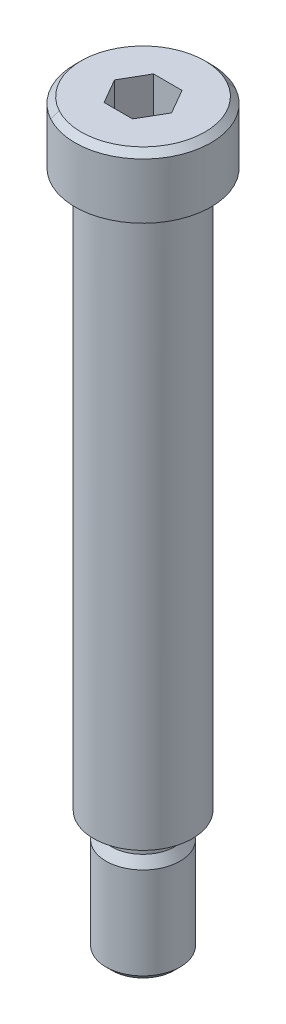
ISO-10303-21;
HEADER;
FILE_DESCRIPTION(('STEP AP214'),'2;1');
FILE_NAME('part.step','',(''),(''),'','','');
FILE_SCHEMA(('AUTOMOTIVE_DESIGN { 1 0 10303 214 1 1 1 1 }'));
ENDSEC;
DATA;
#1=APPLICATION_CONTEXT('core data for automotive mechanical design processes');
#2=APPLICATION_PROTOCOL_DEFINITION('international standard','automotive_design',2000,#1);
#3=PRODUCT_CONTEXT('',#1,'mechanical');
#4=PRODUCT('Part','Part','',(#3));
#5=PRODUCT_RELATED_PRODUCT_CATEGORY('part','',(#4));
#6=PRODUCT_DEFINITION_FORMATION('','',#4);
#7=PRODUCT_DEFINITION_CONTEXT('part definition',#1,'design');
#8=PRODUCT_DEFINITION('design','',#6,#7);
#9=PRODUCT_DEFINITION_SHAPE('','',#8);
#10=(LENGTH_UNIT() NAMED_UNIT(*) SI_UNIT(.MILLI.,.METRE.));
#11=(NAMED_UNIT(*) PLANE_ANGLE_UNIT() SI_UNIT($,.RADIAN.));
#12=(NAMED_UNIT(*) SI_UNIT($,.STERADIAN.) SOLID_ANGLE_UNIT());
#13=UNCERTAINTY_MEASURE_WITH_UNIT(LENGTH_MEASURE(1.E-05),#10,'distance_accuracy_value','');
#14=(GEOMETRIC_REPRESENTATION_CONTEXT(3) GLOBAL_UNCERTAINTY_ASSIGNED_CONTEXT((#13)) GLOBAL_UNIT_ASSIGNED_CONTEXT((#10,
#11,#12)) REPRESENTATION_CONTEXT('',''));
#15=CARTESIAN_POINT('',(0.,0.,0.));
#16=DIRECTION('',(0.,0.,1.));
#17=DIRECTION('',(1.,0.,0.));
#18=AXIS2_PLACEMENT_3D('',#15,#16,#17);
#19=CARTESIAN_POINT('',(0.,-120.,6.00000000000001));
#20=DIRECTION('',(0.,-1.,0.));
#21=DIRECTION('',(0.,0.,-1.));
#22=AXIS2_PLACEMENT_3D('',#19,#20,#21);
#23=PLANE('',#22);
#24=CARTESIAN_POINT('',(0.,-120.00000000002,0.));
#25=DIRECTION('',(0.,1.,0.));
#26=DIRECTION('',(-1.,0.,0.));
#27=AXIS2_PLACEMENT_3D('',#24,#25,#26);
#28=CIRCLE('',#27,5.00000000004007);
#29=CARTESIAN_POINT('',(-2.39712769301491,-120.000000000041,4.38791280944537));
#30=VERTEX_POINT('',#29);
#31=CARTESIAN_POINT('',(2.39712768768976,-120.000000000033,-4.38791281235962));
#32=VERTEX_POINT('',#31);
#33=EDGE_CURVE('E106',#30,#32,#28,.T.);
#34=ORIENTED_EDGE('',*,*,#33,.F.);
#35=CARTESIAN_POINT('',(0.,-120.000000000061,0.));
#36=DIRECTION('',(0.,1.,0.));
#37=DIRECTION('',(-1.,0.,0.));
#38=AXIS2_PLACEMENT_3D('',#35,#36,#37);
#39=CIRCLE('',#38,4.99999999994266);
#40=EDGE_CURVE('E94',#32,#30,#39,.T.);
#41=ORIENTED_EDGE('',*,*,#40,.F.);
#42=EDGE_LOOP('',(#34,#41));
#43=FACE_BOUND('',#42,.T.);
#44=ADVANCED_FACE('F30',(#43),#23,.T.);
#45=CARTESIAN_POINT('',(0.,-119.000000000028,0.));
#46=DIRECTION('',(0.,1.,0.));
#47=DIRECTION('',(-1.,0.,0.));
#48=AXIS2_PLACEMENT_3D('',#45,#46,#47);
#49=CONICAL_SURFACE('',#48,5.99999999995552,0.785398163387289);
#50=CARTESIAN_POINT('',(2.3971276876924,-120.000000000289,-4.38791281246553));
#51=CARTESIAN_POINT('',(2.41710375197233,-119.958333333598,-4.42447875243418));
#52=CARTESIAN_POINT('',(2.43707981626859,-119.916666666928,-4.46104469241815));
#53=CARTESIAN_POINT('',(2.47703194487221,-119.833333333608,-4.53417657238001));
#54=CARTESIAN_POINT('',(2.49700800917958,-119.791666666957,-4.57074251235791));
#55=CARTESIAN_POINT('',(2.53696013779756,-119.708333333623,-4.64387439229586));
#56=CARTESIAN_POINT('',(2.55693620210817,-119.666666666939,-4.68044033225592));
#57=CARTESIAN_POINT('',(2.59688833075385,-119.583333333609,-4.75357221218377));
#58=CARTESIAN_POINT('',(2.61686439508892,-119.541666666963,-4.79013815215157));
#59=CARTESIAN_POINT('',(2.65681652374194,-119.458333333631,-4.86327003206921));
#60=CARTESIAN_POINT('',(2.67679258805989,-119.416666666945,-4.89983597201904));
#61=CARTESIAN_POINT('',(2.71674471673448,-119.333333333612,-4.97296785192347));
#62=CARTESIAN_POINT('',(2.73672078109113,-119.291666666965,-5.00953379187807));
#63=CARTESIAN_POINT('',(2.77667290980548,-119.208333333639,-5.08266567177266));
#64=CARTESIAN_POINT('',(2.79664897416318,-119.16666666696,-5.11923161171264));
#65=CARTESIAN_POINT('',(2.83660110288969,-119.083333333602,-5.19236349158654));
#66=CARTESIAN_POINT('',(2.8565771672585,-119.041666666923,-5.22892943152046));
#67=CARTESIAN_POINT('',(2.87655323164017,-119.000000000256,-5.26549537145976));
#68=B_SPLINE_CURVE_WITH_KNOTS('',3,(#50,#51,#52,#53,#54,#55,#56,#57,#58,#59,#60,#61,#62,#63,#64,
#65,#66,#67),.UNSPECIFIED.,.F.,.F.,(4,2,2,2,2,2,2,2,4),(0.,0.176776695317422,0.353553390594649,
0.530330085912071,0.707106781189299,0.883883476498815,1.06066017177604,1.23743686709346,
1.41421356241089),.UNSPECIFIED.);
#69=CARTESIAN_POINT('',(2.87655323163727,-119.000000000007,-5.26549537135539));
#70=VERTEX_POINT('',#69);
#71=EDGE_CURVE('E101',#32,#70,#68,.T.);
#72=ORIENTED_EDGE('',*,*,#71,.F.);
#73=ORIENTED_EDGE('',*,*,#40,.T.);
#74=DIRECTION('',(0.339005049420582,-0.707106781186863,-0.620544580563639));
#75=VECTOR('',#74,1.);
#76=CARTESIAN_POINT('',(-239293.271955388,498999.999999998,438023.39620326));
#77=LINE('',#76,#75);
#78=CARTESIAN_POINT('',(-2.87655323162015,-119.00000000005,5.26549537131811));
#79=VERTEX_POINT('',#78);
#80=EDGE_CURVE('E98',#79,#30,#77,.T.);
#81=ORIENTED_EDGE('',*,*,#80,.F.);
#82=CARTESIAN_POINT('',(0.,-119.,0.));
#83=DIRECTION('',(0.,-1.,0.));
#84=DIRECTION('',(0.,0.,-1.));
#85=AXIS2_PLACEMENT_3D('',#82,#83,#84);
#86=CIRCLE('',#85,6.);
#87=EDGE_CURVE('E108',#70,#79,#86,.F.);
#88=ORIENTED_EDGE('',*,*,#87,.F.);
#89=EDGE_LOOP('',(#72,#73,#81,#88));
#90=FACE_BOUND('',#89,.T.);
#91=ADVANCED_FACE('F96',(#90),#49,.T.);
#92=CARTESIAN_POINT('',(0.,-119.000000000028,0.));
#93=DIRECTION('',(0.,1.,0.));
#94=DIRECTION('',(-1.,0.,0.));
#95=AXIS2_PLACEMENT_3D('',#92,#93,#94);
#96=CONICAL_SURFACE('',#95,6.00000000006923,0.785398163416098);
#97=ORIENTED_EDGE('',*,*,#80,.T.);
#98=ORIENTED_EDGE('',*,*,#33,.T.);
#99=ORIENTED_EDGE('',*,*,#71,.T.);
#100=CARTESIAN_POINT('',(0.,-119.,0.));
#101=DIRECTION('',(0.,-1.,0.));
#102=DIRECTION('',(0.,0.,-1.));
#103=AXIS2_PLACEMENT_3D('',#100,#101,#102);
#104=CIRCLE('',#103,6.);
#105=EDGE_CURVE('E113',#79,#70,#104,.F.);
#106=ORIENTED_EDGE('',*,*,#105,.F.);
#107=EDGE_LOOP('',(#97,#98,#99,#106));
#108=FACE_BOUND('',#107,.T.);
#109=ADVANCED_FACE('F111',(#108),#96,.T.);
#110=CARTESIAN_POINT('',(0.,-60.,0.));
#111=DIRECTION('',(0.,-1.,0.));
#112=DIRECTION('',(0.,0.,-1.));
#113=AXIS2_PLACEMENT_3D('',#110,#111,#112);
#114=CYLINDRICAL_SURFACE('',#113,6.);
#115=CARTESIAN_POINT('',(0.,-104.158845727,0.));
#116=DIRECTION('',(0.,-1.,0.));
#117=DIRECTION('',(-0.479425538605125,0.,0.877582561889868));
#118=AXIS2_PLACEMENT_3D('',#115,#116,#117);
#119=CIRCLE('',#118,6.0000000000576);
#120=CARTESIAN_POINT('',(-2.87655323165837,-104.158845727,5.26549537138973));
#121=VERTEX_POINT('',#120);
#122=EDGE_CURVE('E170',#121,#121,#119,.F.);
#123=ORIENTED_EDGE('',*,*,#122,.F.);
#124=EDGE_LOOP('',(#123));
#125=FACE_BOUND('',#124,.T.);
#126=ORIENTED_EDGE('',*,*,#105,.T.);
#127=ORIENTED_EDGE('',*,*,#87,.T.);
#128=EDGE_LOOP('',(#126,#127));
#129=FACE_BOUND('',#128,.T.);
#130=ADVANCED_FACE('F177',(#125,#129),#114,.T.);
#131=CARTESIAN_POINT('',(0.,0.,0.));
#132=DIRECTION('',(0.,-1.,0.));
#133=DIRECTION('',(0.,0.,-1.));
#134=AXIS2_PLACEMENT_3D('',#131,#132,#133);
#135=PLANE('',#134);
#136=DIRECTION('',(-0.5,0.,-0.866025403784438));
#137=VECTOR('',#136,1.);
#138=CARTESIAN_POINT('',(4.61880215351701,0.,0.));
#139=LINE('',#138,#137);
#140=CARTESIAN_POINT('',(4.61880215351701,0.,0.));
#141=VERTEX_POINT('',#140);
#142=CARTESIAN_POINT('',(2.30940107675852,0.,-3.99999999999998));
#143=VERTEX_POINT('',#142);
#144=EDGE_CURVE('E536',#141,#143,#139,.T.);
#145=ORIENTED_EDGE('',*,*,#144,.F.);
#146=DIRECTION('',(0.5,0.,-0.866025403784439));
#147=VECTOR('',#146,1.);
#148=CARTESIAN_POINT('',(2.3094010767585,0.,4.));
#149=LINE('',#148,#147);
#150=CARTESIAN_POINT('',(2.3094010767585,0.,4.));
#151=VERTEX_POINT('',#150);
#152=EDGE_CURVE('E49',#151,#141,#149,.T.);
#153=ORIENTED_EDGE('',*,*,#152,.F.);
#154=DIRECTION('',(1.,0.,0.));
#155=VECTOR('',#154,1.);
#156=CARTESIAN_POINT('',(-2.3094010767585,0.,4.));
#157=LINE('',#156,#155);
#158=CARTESIAN_POINT('',(-2.3094010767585,0.,4.));
#159=VERTEX_POINT('',#158);
#160=EDGE_CURVE('E503',#159,#151,#157,.T.);
#161=ORIENTED_EDGE('',*,*,#160,.F.);
#162=DIRECTION('',(0.5,0.,0.866025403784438));
#163=VECTOR('',#162,1.);
#164=CARTESIAN_POINT('',(-4.61880215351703,0.,0.));
#165=LINE('',#164,#163);
#166=CARTESIAN_POINT('',(-4.61880215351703,0.,0.));
#167=VERTEX_POINT('',#166);
#168=EDGE_CURVE('E508',#167,#159,#165,.T.);
#169=ORIENTED_EDGE('',*,*,#168,.F.);
#170=DIRECTION('',(-0.5,0.,0.866025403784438));
#171=VECTOR('',#170,1.);
#172=CARTESIAN_POINT('',(-2.3094010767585,0.,-4.));
#173=LINE('',#172,#171);
#174=CARTESIAN_POINT('',(-2.3094010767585,0.,-4.));
#175=VERTEX_POINT('',#174);
#176=EDGE_CURVE('E542',#175,#167,#173,.T.);
#177=ORIENTED_EDGE('',*,*,#176,.F.);
#178=DIRECTION('',(-1.,0.,0.));
#179=VECTOR('',#178,1.);
#180=CARTESIAN_POINT('',(2.30940107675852,0.,-3.99999999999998));
#181=LINE('',#180,#179);
#182=EDGE_CURVE('E540',#143,#175,#181,.T.);
#183=ORIENTED_EDGE('',*,*,#182,.F.);
#184=EDGE_LOOP('',(#145,#153,#161,#169,#177,#183));
#185=FACE_BOUND('',#184,.T.);
#186=CARTESIAN_POINT('',(0.,5.99173488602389E-12,0.));
#187=DIRECTION('',(0.,-1.,0.));
#188=DIRECTION('',(0.,0.,-1.));
#189=AXIS2_PLACEMENT_3D('',#186,#187,#188);
#190=CIRCLE('',#189,9.99999999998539);
#191=CARTESIAN_POINT('',(4.79425457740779,2.9767854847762E-12,-8.77582606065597));
#192=VERTEX_POINT('',#191);
#193=CARTESIAN_POINT('',(-4.79425538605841,-2.54136989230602E-11,8.77582561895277));
#194=VERTEX_POINT('',#193);
#195=EDGE_CURVE('E173',#192,#194,#190,.T.);
#196=ORIENTED_EDGE('',*,*,#195,.F.);
#197=CARTESIAN_POINT('',(0.,0.,0.));
#198=DIRECTION('',(0.,-1.,0.));
#199=DIRECTION('',(1.,0.,0.));
#200=AXIS2_PLACEMENT_3D('',#197,#198,#199);
#201=CIRCLE('',#200,10.0000000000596);
#202=EDGE_CURVE('E471',#194,#192,#201,.T.);
#203=ORIENTED_EDGE('',*,*,#202,.F.);
#204=EDGE_LOOP('',(#196,#203));
#205=FACE_BOUND('',#204,.T.);
#206=ADVANCED_FACE('F179',(#185,#205),#135,.F.);
#207=CARTESIAN_POINT('',(0.,-104.158845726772,0.));
#208=DIRECTION('',(0.,-1.,0.));
#209=DIRECTION('',(1.,0.,0.));
#210=AXIS2_PLACEMENT_3D('',#207,#208,#209);
#211=CONICAL_SURFACE('',#210,5.99999999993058,0.523598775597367);
#212=ORIENTED_EDGE('',*,*,#122,.T.);
#213=EDGE_LOOP('',(#212));
#214=FACE_BOUND('',#213,.T.);
#215=CARTESIAN_POINT('',(0.,-102.6,0.));
#216=DIRECTION('',(0.,-1.,0.));
#217=DIRECTION('',(0.,0.,-1.));
#218=AXIS2_PLACEMENT_3D('',#215,#216,#217);
#219=CIRCLE('',#218,5.1);
#220=CARTESIAN_POINT('',(0.,-102.6,-5.10000000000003));
#221=VERTEX_POINT('',#220);
#222=EDGE_CURVE('E161',#221,#221,#219,.F.);
#223=ORIENTED_EDGE('',*,*,#222,.F.);
#224=EDGE_LOOP('',(#223));
#225=FACE_BOUND('',#224,.T.);
#226=ADVANCED_FACE('F185',(#214,#225),#211,.T.);
#227=CARTESIAN_POINT('',(0.,-0.999999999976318,0.));
#228=DIRECTION('',(0.,-1.,0.));
#229=DIRECTION('',(0.,0.,-1.));
#230=AXIS2_PLACEMENT_3D('',#227,#228,#229);
#231=CONICAL_SURFACE('',#230,11.0000000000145,0.785398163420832);
#232=DIRECTION('',(0.339005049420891,0.707106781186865,-0.620544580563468));
#233=VECTOR('',#232,1.);
#234=CARTESIAN_POINT('',(-239238.138018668,-499000.,437922.474208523));
#235=LINE('',#234,#233);
#236=CARTESIAN_POINT('',(-5.27368092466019,-1.00000000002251,9.65340818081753));
#237=VERTEX_POINT('',#236);
#238=EDGE_CURVE('E470',#237,#194,#235,.T.);
#239=ORIENTED_EDGE('',*,*,#238,.F.);
#240=CARTESIAN_POINT('',(0.,-1.,0.));
#241=DIRECTION('',(0.,-1.,0.));
#242=DIRECTION('',(0.,0.,-1.));
#243=AXIS2_PLACEMENT_3D('',#240,#241,#242);
#244=CIRCLE('',#243,11.);
#245=CARTESIAN_POINT('',(5.27368092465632,-1.0000000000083,-9.65340818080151));
#246=VERTEX_POINT('',#245);
#247=EDGE_CURVE('E169',#246,#237,#244,.T.);
#248=ORIENTED_EDGE('',*,*,#247,.F.);
#249=CARTESIAN_POINT('',(4.79425457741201,5.68364799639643E-11,-8.77582606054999));
#250=CARTESIAN_POINT('',(4.81423067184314,-0.041666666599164,-8.81239198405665));
#251=CARTESIAN_POINT('',(4.83420676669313,-0.0833333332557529,-8.8489579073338));
#252=CARTESIAN_POINT('',(4.87415895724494,-0.166666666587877,-8.92208975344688));
#253=CARTESIAN_POINT('',(4.89413505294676,-0.208333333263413,-8.95865567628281));
#254=CARTESIAN_POINT('',(4.93408724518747,-0.291666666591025,-9.03178752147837));
#255=CARTESIAN_POINT('',(4.95406334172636,-0.333333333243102,-9.06835344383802));
#256=CARTESIAN_POINT('',(4.99401553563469,-0.416666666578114,-9.14148528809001));
#257=CARTESIAN_POINT('',(5.01399163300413,-0.45833333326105,-9.17805120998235));
#258=CARTESIAN_POINT('',(5.05394382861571,-0.541666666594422,-9.2511830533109));
#259=CARTESIAN_POINT('',(5.07391992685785,-0.583333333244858,-9.2877489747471));
#260=CARTESIAN_POINT('',(5.11387212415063,-0.666666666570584,-9.36088081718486));
#261=CARTESIAN_POINT('',(5.13384822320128,-0.708333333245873,-9.39744673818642));
#262=CARTESIAN_POINT('',(5.17380042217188,-0.79166666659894,-9.47057857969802));
#263=CARTESIAN_POINT('',(5.19377652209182,-0.833333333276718,-9.50714450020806));
#264=CARTESIAN_POINT('',(5.23372872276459,-0.916666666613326,-9.58027634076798));
#265=CARTESIAN_POINT('',(5.25370482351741,-0.958333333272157,-9.61684226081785));
#266=CARTESIAN_POINT('',(5.27368092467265,-0.999999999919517,-9.65340818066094));
#267=B_SPLINE_CURVE_WITH_KNOTS('',3,(#249,#250,#251,#252,#253,#254,#255,#256,#257,#258,#259,
#260,#261,#262,#263,#264,#265,#266),.UNSPECIFIED.,.F.,.F.,(4,2,2,2,2,2,2,2,4),(0.,
0.1767766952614,0.353553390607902,0.530330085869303,0.707106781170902,0.883883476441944,
1.06066017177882,1.23743686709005,1.41421356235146),.UNSPECIFIED.);
#268=EDGE_CURVE('E159',#192,#246,#267,.T.);
#269=ORIENTED_EDGE('',*,*,#268,.F.);
#270=ORIENTED_EDGE('',*,*,#195,.T.);
#271=EDGE_LOOP('',(#239,#248,#269,#270));
#272=FACE_BOUND('',#271,.T.);
#273=ADVANCED_FACE('F150',(#272),#231,.T.);
#274=CARTESIAN_POINT('',(0.,-1.00000000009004,0.));
#275=DIRECTION('',(0.,-1.,0.));
#276=DIRECTION('',(1.,0.,0.));
#277=AXIS2_PLACEMENT_3D('',#274,#275,#276);
#278=CONICAL_SURFACE('',#277,11.000000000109,0.785398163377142);
#279=ORIENTED_EDGE('',*,*,#268,.T.);
#280=CARTESIAN_POINT('',(0.,-1.,0.));
#281=DIRECTION('',(0.,-1.,0.));
#282=DIRECTION('',(0.,0.,-1.));
#283=AXIS2_PLACEMENT_3D('',#280,#281,#282);
#284=CIRCLE('',#283,11.);
#285=EDGE_CURVE('E460',#237,#246,#284,.T.);
#286=ORIENTED_EDGE('',*,*,#285,.F.);
#287=ORIENTED_EDGE('',*,*,#238,.T.);
#288=ORIENTED_EDGE('',*,*,#202,.T.);
#289=EDGE_LOOP('',(#279,#286,#287,#288));
#290=FACE_BOUND('',#289,.T.);
#291=ADVANCED_FACE('F152',(#290),#278,.T.);
#292=CARTESIAN_POINT('',(0.,-60.,0.));
#293=DIRECTION('',(0.,-1.,0.));
#294=DIRECTION('',(0.,0.,-1.));
#295=AXIS2_PLACEMENT_3D('',#292,#293,#294);
#296=CYLINDRICAL_SURFACE('',#295,5.1);
#297=ORIENTED_EDGE('',*,*,#222,.T.);
#298=EDGE_LOOP('',(#297));
#299=FACE_BOUND('',#298,.T.);
#300=CARTESIAN_POINT('',(0.,-100.9,0.));
#301=DIRECTION('',(0.,-1.,0.));
#302=DIRECTION('',(-0.479425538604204,0.,0.877582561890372));
#303=AXIS2_PLACEMENT_3D('',#300,#301,#302);
#304=CIRCLE('',#303,5.1);
#305=CARTESIAN_POINT('',(-2.44507024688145,-100.9,4.47567106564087));
#306=VERTEX_POINT('',#305);
#307=EDGE_CURVE('E248',#306,#306,#304,.T.);
#308=ORIENTED_EDGE('',*,*,#307,.T.);
#309=EDGE_LOOP('',(#308));
#310=FACE_BOUND('',#309,.T.);
#311=ADVANCED_FACE('F423',(#299,#310),#296,.T.);
#312=CARTESIAN_POINT('',(0.,-60.,0.));
#313=DIRECTION('',(0.,-1.,0.));
#314=DIRECTION('',(0.,0.,-1.));
#315=AXIS2_PLACEMENT_3D('',#312,#313,#314);
#316=CYLINDRICAL_SURFACE('',#315,11.);
#317=CARTESIAN_POINT('',(0.,-10.,0.));
#318=DIRECTION('',(0.,-1.,0.));
#319=DIRECTION('',(0.,0.,-1.));
#320=AXIS2_PLACEMENT_3D('',#317,#318,#319);
#321=CIRCLE('',#320,11.);
#322=CARTESIAN_POINT('',(0.,-10.,-11.));
#323=VERTEX_POINT('',#322);
#324=EDGE_CURVE('E211',#323,#323,#321,.T.);
#325=ORIENTED_EDGE('',*,*,#324,.F.);
#326=EDGE_LOOP('',(#325));
#327=FACE_BOUND('',#326,.T.);
#328=ORIENTED_EDGE('',*,*,#285,.T.);
#329=ORIENTED_EDGE('',*,*,#247,.T.);
#330=EDGE_LOOP('',(#328,#329));
#331=FACE_BOUND('',#330,.T.);
#332=ADVANCED_FACE('F260',(#327,#331),#316,.T.);
#333=CARTESIAN_POINT('',(0.,-100.9,0.));
#334=DIRECTION('',(0.,-1.,0.));
#335=DIRECTION('',(-0.479425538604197,0.,0.877582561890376));
#336=AXIS2_PLACEMENT_3D('',#333,#334,#335);
#337=TOROIDAL_SURFACE('',#336,6.00000000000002,0.9);
#338=ORIENTED_EDGE('',*,*,#307,.F.);
#339=EDGE_LOOP('',(#338));
#340=FACE_BOUND('',#339,.T.);
#341=CARTESIAN_POINT('',(0.,-100.,0.));
#342=DIRECTION('',(0.,-1.,0.));
#343=DIRECTION('',(-0.479425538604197,0.,0.877582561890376));
#344=AXIS2_PLACEMENT_3D('',#341,#342,#343);
#345=CIRCLE('',#344,6.00000000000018);
#346=CARTESIAN_POINT('',(2.87655323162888,-100.,-5.26549537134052));
#347=VERTEX_POINT('',#346);
#348=CARTESIAN_POINT('',(-2.87655323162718,-100.,5.2654953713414));
#349=VERTEX_POINT('',#348);
#350=EDGE_CURVE('E210',#347,#349,#345,.F.);
#351=ORIENTED_EDGE('',*,*,#350,.F.);
#352=CARTESIAN_POINT('',(0.,-100.,0.));
#353=DIRECTION('',(0.,-1.,0.));
#354=DIRECTION('',(0.479425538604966,0.,-0.877582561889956));
#355=AXIS2_PLACEMENT_3D('',#352,#353,#354);
#356=CIRCLE('',#355,6.00000000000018);
#357=EDGE_CURVE('E243',#349,#347,#356,.F.);
#358=ORIENTED_EDGE('',*,*,#357,.F.);
#359=EDGE_LOOP('',(#351,#358));
#360=FACE_BOUND('',#359,.T.);
#361=ADVANCED_FACE('F250',(#340,#360),#337,.F.);
#362=CARTESIAN_POINT('',(0.,-10.,11.));
#363=DIRECTION('',(0.,-1.,0.));
#364=DIRECTION('',(0.,0.,-1.));
#365=AXIS2_PLACEMENT_3D('',#362,#363,#364);
#366=PLANE('',#365);
#367=CARTESIAN_POINT('',(0.,-10.,0.));
#368=DIRECTION('',(0.,-1.,0.));
#369=DIRECTION('',(-0.479425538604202,0.,0.877582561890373));
#370=AXIS2_PLACEMENT_3D('',#367,#368,#369);
#371=CIRCLE('',#370,7.99999999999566);
#372=CARTESIAN_POINT('',(3.83540430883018,-10.,-7.02066049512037));
#373=VERTEX_POINT('',#372);
#374=CARTESIAN_POINT('',(-3.83540430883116,-10.,7.02066049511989));
#375=VERTEX_POINT('',#374);
#376=EDGE_CURVE('E57',#373,#375,#371,.F.);
#377=ORIENTED_EDGE('',*,*,#376,.T.);
#378=CARTESIAN_POINT('',(0.,-10.,0.));
#379=DIRECTION('',(0.,-1.,0.));
#380=DIRECTION('',(0.479425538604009,0.,-0.877582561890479));
#381=AXIS2_PLACEMENT_3D('',#378,#379,#380);
#382=CIRCLE('',#381,7.99999999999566);
#383=EDGE_CURVE('E206',#375,#373,#382,.F.);
#384=ORIENTED_EDGE('',*,*,#383,.T.);
#385=EDGE_LOOP('',(#377,#384));
#386=FACE_BOUND('',#385,.T.);
#387=ORIENTED_EDGE('',*,*,#324,.T.);
#388=EDGE_LOOP('',(#387));
#389=FACE_BOUND('',#388,.T.);
#390=ADVANCED_FACE('F259',(#386,#389),#366,.T.);
#391=CARTESIAN_POINT('',(0.,-100.,7.99999999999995));
#392=DIRECTION('',(0.,-1.,0.));
#393=DIRECTION('',(0.,0.,-1.));
#394=AXIS2_PLACEMENT_3D('',#391,#392,#393);
#395=PLANE('',#394);
#396=ORIENTED_EDGE('',*,*,#350,.T.);
#397=ORIENTED_EDGE('',*,*,#357,.T.);
#398=EDGE_LOOP('',(#396,#397));
#399=FACE_BOUND('',#398,.T.);
#400=CARTESIAN_POINT('',(0.,-100.,0.));
#401=DIRECTION('',(0.,-1.,0.));
#402=DIRECTION('',(0.,0.,-1.));
#403=AXIS2_PLACEMENT_3D('',#400,#401,#402);
#404=CIRCLE('',#403,8.);
#405=CARTESIAN_POINT('',(0.,-100.,-8.00000000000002));
#406=VERTEX_POINT('',#405);
#407=EDGE_CURVE('E41',#406,#406,#404,.F.);
#408=ORIENTED_EDGE('',*,*,#407,.F.);
#409=EDGE_LOOP('',(#408));
#410=FACE_BOUND('',#409,.T.);
#411=ADVANCED_FACE('F199',(#399,#410),#395,.T.);
#412=CARTESIAN_POINT('',(0.,-10.9,0.));
#413=DIRECTION('',(0.,-1.,0.));
#414=DIRECTION('',(-0.479425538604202,0.,0.877582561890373));
#415=AXIS2_PLACEMENT_3D('',#412,#413,#414);
#416=TOROIDAL_SURFACE('',#415,8.00000000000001,0.9);
#417=CARTESIAN_POINT('',(0.,-11.8,0.));
#418=DIRECTION('',(0.,-1.,0.));
#419=DIRECTION('',(0.,0.,-1.));
#420=AXIS2_PLACEMENT_3D('',#417,#418,#419);
#421=CIRCLE('',#420,8.);
#422=CARTESIAN_POINT('',(0.,-11.8,-8.));
#423=VERTEX_POINT('',#422);
#424=EDGE_CURVE('E11',#423,#423,#421,.T.);
#425=ORIENTED_EDGE('',*,*,#424,.F.);
#426=EDGE_LOOP('',(#425));
#427=FACE_BOUND('',#426,.T.);
#428=ORIENTED_EDGE('',*,*,#383,.F.);
#429=ORIENTED_EDGE('',*,*,#376,.F.);
#430=EDGE_LOOP('',(#428,#429));
#431=FACE_BOUND('',#430,.T.);
#432=ADVANCED_FACE('F191',(#427,#431),#416,.F.);
#433=CARTESIAN_POINT('',(0.,-60.,0.));
#434=DIRECTION('',(0.,-1.,0.));
#435=DIRECTION('',(0.,0.,-1.));
#436=AXIS2_PLACEMENT_3D('',#433,#434,#435);
#437=CYLINDRICAL_SURFACE('',#436,8.);
#438=ORIENTED_EDGE('',*,*,#407,.T.);
#439=EDGE_LOOP('',(#438));
#440=FACE_BOUND('',#439,.T.);
#441=ORIENTED_EDGE('',*,*,#424,.T.);
#442=EDGE_LOOP('',(#441));
#443=FACE_BOUND('',#442,.T.);
#444=ADVANCED_FACE('F32',(#440,#443),#437,.T.);
#445=CARTESIAN_POINT('',(2.3094010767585,-6.,4.));
#446=DIRECTION('',(0.866025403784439,0.,0.5));
#447=DIRECTION('',(0.5,0.,-0.866025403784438));
#448=AXIS2_PLACEMENT_3D('',#445,#446,#447);
#449=PLANE('',#448);
#450=ORIENTED_EDGE('',*,*,#152,.T.);
#451=DIRECTION('',(0.,1.,0.));
#452=VECTOR('',#451,1.);
#453=CARTESIAN_POINT('',(4.61880215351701,-6.00000000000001,0.));
#454=LINE('',#453,#452);
#455=CARTESIAN_POINT('',(4.61880215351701,-6.00000000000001,0.));
#456=VERTEX_POINT('',#455);
#457=EDGE_CURVE('E141',#456,#141,#454,.T.);
#458=ORIENTED_EDGE('',*,*,#457,.F.);
#459=DIRECTION('',(0.5,0.,-0.866025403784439));
#460=VECTOR('',#459,1.);
#461=CARTESIAN_POINT('',(2.3094010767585,-6.,4.));
#462=LINE('',#461,#460);
#463=CARTESIAN_POINT('',(2.3094010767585,-6.,4.));
#464=VERTEX_POINT('',#463);
#465=EDGE_CURVE('E493',#464,#456,#462,.T.);
#466=ORIENTED_EDGE('',*,*,#465,.F.);
#467=DIRECTION('',(0.,1.,0.));
#468=VECTOR('',#467,1.);
#469=CARTESIAN_POINT('',(2.3094010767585,-6.,4.));
#470=LINE('',#469,#468);
#471=EDGE_CURVE('E104',#464,#151,#470,.T.);
#472=ORIENTED_EDGE('',*,*,#471,.T.);
#473=EDGE_LOOP('',(#450,#458,#466,#472));
#474=FACE_BOUND('',#473,.T.);
#475=ADVANCED_FACE('F190',(#474),#449,.F.);
#476=CARTESIAN_POINT('',(-2.30940107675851,-6.,4.));
#477=DIRECTION('',(0.,0.,1.));
#478=DIRECTION('',(1.,0.,0.));
#479=AXIS2_PLACEMENT_3D('',#476,#477,#478);
#480=PLANE('',#479);
#481=ORIENTED_EDGE('',*,*,#160,.T.);
#482=ORIENTED_EDGE('',*,*,#471,.F.);
#483=DIRECTION('',(1.,0.,0.));
#484=VECTOR('',#483,1.);
#485=CARTESIAN_POINT('',(-2.30940107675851,-6.,4.));
#486=LINE('',#485,#484);
#487=CARTESIAN_POINT('',(-2.30940107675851,-6.,4.));
#488=VERTEX_POINT('',#487);
#489=EDGE_CURVE('E500',#488,#464,#486,.T.);
#490=ORIENTED_EDGE('',*,*,#489,.F.);
#491=DIRECTION('',(0.,1.,0.));
#492=VECTOR('',#491,1.);
#493=CARTESIAN_POINT('',(-2.30940107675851,-6.,4.));
#494=LINE('',#493,#492);
#495=EDGE_CURVE('E520',#488,#159,#494,.T.);
#496=ORIENTED_EDGE('',*,*,#495,.T.);
#497=EDGE_LOOP('',(#481,#482,#490,#496));
#498=FACE_BOUND('',#497,.T.);
#499=ADVANCED_FACE('F197',(#498),#480,.F.);
#500=CARTESIAN_POINT('',(-4.618802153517,-6.,0.));
#501=DIRECTION('',(-0.866025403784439,0.,0.5));
#502=DIRECTION('',(0.5,0.,0.866025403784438));
#503=AXIS2_PLACEMENT_3D('',#500,#501,#502);
#504=PLANE('',#503);
#505=ORIENTED_EDGE('',*,*,#168,.T.);
#506=ORIENTED_EDGE('',*,*,#495,.F.);
#507=DIRECTION('',(0.5,0.,0.866025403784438));
#508=VECTOR('',#507,1.);
#509=CARTESIAN_POINT('',(-4.618802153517,-6.,0.));
#510=LINE('',#509,#508);
#511=CARTESIAN_POINT('',(-4.618802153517,-6.,0.));
#512=VERTEX_POINT('',#511);
#513=EDGE_CURVE('E516',#512,#488,#510,.T.);
#514=ORIENTED_EDGE('',*,*,#513,.F.);
#515=DIRECTION('',(0.,1.,0.));
#516=VECTOR('',#515,1.);
#517=CARTESIAN_POINT('',(-4.618802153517,-6.,0.));
#518=LINE('',#517,#516);
#519=EDGE_CURVE('E523',#512,#167,#518,.T.);
#520=ORIENTED_EDGE('',*,*,#519,.T.);
#521=EDGE_LOOP('',(#505,#506,#514,#520));
#522=FACE_BOUND('',#521,.T.);
#523=ADVANCED_FACE('F324',(#522),#504,.F.);
#524=CARTESIAN_POINT('',(-2.3094010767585,-6.,-4.));
#525=DIRECTION('',(-0.866025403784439,0.,-0.499999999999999));
#526=DIRECTION('',(-0.5,0.,0.866025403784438));
#527=AXIS2_PLACEMENT_3D('',#524,#525,#526);
#528=PLANE('',#527);
#529=ORIENTED_EDGE('',*,*,#176,.T.);
#530=ORIENTED_EDGE('',*,*,#519,.F.);
#531=DIRECTION('',(-0.5,0.,0.866025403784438));
#532=VECTOR('',#531,1.);
#533=CARTESIAN_POINT('',(-2.3094010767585,-6.,-4.));
#534=LINE('',#533,#532);
#535=CARTESIAN_POINT('',(-2.3094010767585,-6.,-4.));
#536=VERTEX_POINT('',#535);
#537=EDGE_CURVE('E513',#536,#512,#534,.T.);
#538=ORIENTED_EDGE('',*,*,#537,.F.);
#539=DIRECTION('',(0.,1.,0.));
#540=VECTOR('',#539,1.);
#541=CARTESIAN_POINT('',(-2.3094010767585,-6.,-4.));
#542=LINE('',#541,#540);
#543=EDGE_CURVE('E526',#536,#175,#542,.T.);
#544=ORIENTED_EDGE('',*,*,#543,.T.);
#545=EDGE_LOOP('',(#529,#530,#538,#544));
#546=FACE_BOUND('',#545,.T.);
#547=ADVANCED_FACE('F334',(#546),#528,.F.);
#548=CARTESIAN_POINT('',(2.30940107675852,-6.,-3.99999999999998));
#549=DIRECTION('',(0.,0.,-1.));
#550=DIRECTION('',(-1.,0.,0.));
#551=AXIS2_PLACEMENT_3D('',#548,#549,#550);
#552=PLANE('',#551);
#553=ORIENTED_EDGE('',*,*,#182,.T.);
#554=ORIENTED_EDGE('',*,*,#543,.F.);
#555=DIRECTION('',(-1.,0.,0.));
#556=VECTOR('',#555,1.);
#557=CARTESIAN_POINT('',(2.30940107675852,-6.,-3.99999999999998));
#558=LINE('',#557,#556);
#559=CARTESIAN_POINT('',(2.30940107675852,-6.,-3.99999999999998));
#560=VERTEX_POINT('',#559);
#561=EDGE_CURVE('E505',#560,#536,#558,.T.);
#562=ORIENTED_EDGE('',*,*,#561,.F.);
#563=DIRECTION('',(0.,1.,0.));
#564=VECTOR('',#563,1.);
#565=CARTESIAN_POINT('',(2.30940107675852,-6.,-3.99999999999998));
#566=LINE('',#565,#564);
#567=EDGE_CURVE('E528',#560,#143,#566,.T.);
#568=ORIENTED_EDGE('',*,*,#567,.T.);
#569=EDGE_LOOP('',(#553,#554,#562,#568));
#570=FACE_BOUND('',#569,.T.);
#571=ADVANCED_FACE('F344',(#570),#552,.F.);
#572=CARTESIAN_POINT('',(4.61880215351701,-6.00000000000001,0.));
#573=DIRECTION('',(0.866025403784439,0.,-0.5));
#574=DIRECTION('',(-0.5,0.,-0.866025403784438));
#575=AXIS2_PLACEMENT_3D('',#572,#573,#574);
#576=PLANE('',#575);
#577=ORIENTED_EDGE('',*,*,#144,.T.);
#578=ORIENTED_EDGE('',*,*,#567,.F.);
#579=DIRECTION('',(-0.5,0.,-0.866025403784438));
#580=VECTOR('',#579,1.);
#581=CARTESIAN_POINT('',(4.61880215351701,-6.00000000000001,0.));
#582=LINE('',#581,#580);
#583=EDGE_CURVE('E497',#456,#560,#582,.T.);
#584=ORIENTED_EDGE('',*,*,#583,.F.);
#585=ORIENTED_EDGE('',*,*,#457,.T.);
#586=EDGE_LOOP('',(#577,#578,#584,#585));
#587=FACE_BOUND('',#586,.T.);
#588=ADVANCED_FACE('F354',(#587),#576,.F.);
#589=CARTESIAN_POINT('',(6.92820323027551,-6.,-4.));
#590=DIRECTION('',(0.,1.,0.));
#591=DIRECTION('',(0.,0.,1.));
#592=AXIS2_PLACEMENT_3D('',#589,#590,#591);
#593=PLANE('',#592);
#594=ORIENTED_EDGE('',*,*,#465,.T.);
#595=ORIENTED_EDGE('',*,*,#583,.T.);
#596=ORIENTED_EDGE('',*,*,#561,.T.);
#597=ORIENTED_EDGE('',*,*,#537,.T.);
#598=ORIENTED_EDGE('',*,*,#513,.T.);
#599=ORIENTED_EDGE('',*,*,#489,.T.);
#600=EDGE_LOOP('',(#594,#595,#596,#597,#598,#599));
#601=FACE_BOUND('',#600,.T.);
#602=ADVANCED_FACE('F364',(#601),#593,.T.);
#603=CLOSED_SHELL('',(#44,#91,#109,#130,#206,#226,#273,#291,#311,#332,#361,#390,#411,#432,#444,
#475,#499,#523,#547,#571,#588,#602));
#604=MANIFOLD_SOLID_BREP('B2',#603);
#605=ADVANCED_BREP_SHAPE_REPRESENTATION('',(#18,#604),#14);
#606=SHAPE_DEFINITION_REPRESENTATION(#9,#605);
ENDSEC;
END-ISO-10303-21;
